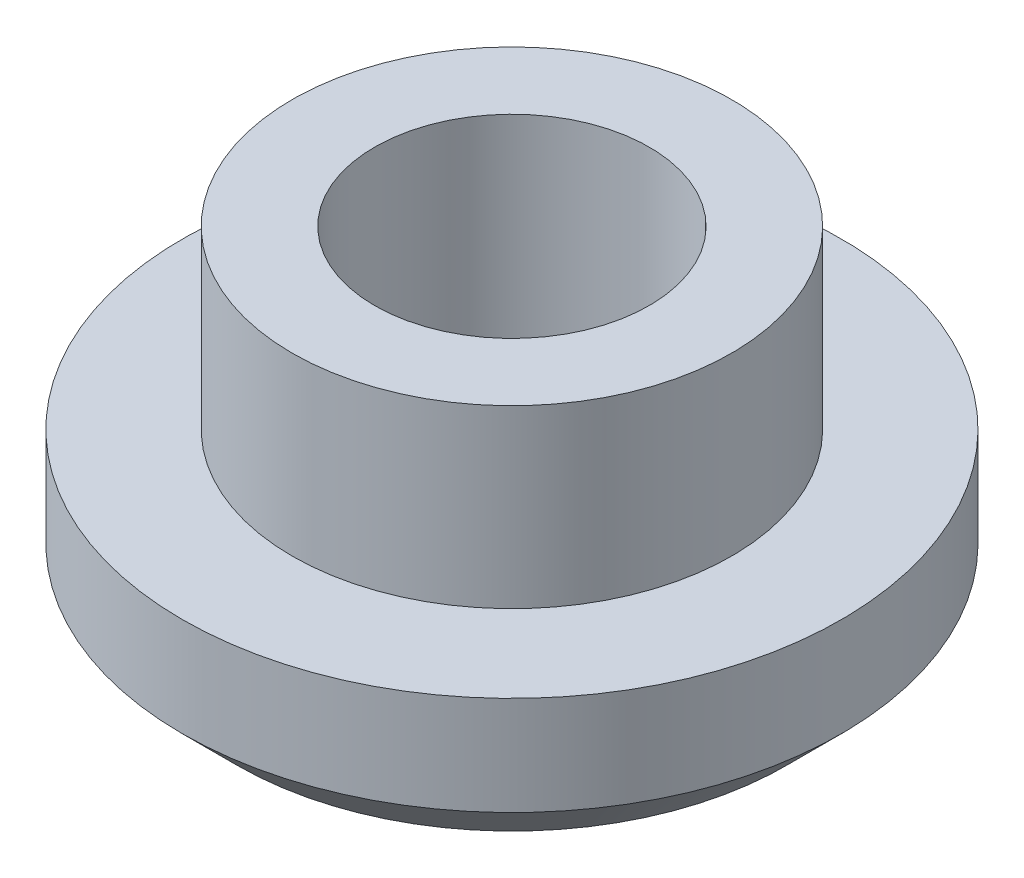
from build123d import *

# Parameters (mm, degrees)
SKETCH1_R      = 6
EXTRUDE1_DEPTH = 2.8
CHAMFER1_SIZE  = 1
SKETCH2_R      = 4
EXTRUDE2_DEPTH = 3.2
SKETCH3_R      = 2.5
EXTRUDE3_DEPTH = 11.392304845


with BuildPart() as part:
    # Sketch1 → Extrude1 (new body)
    with BuildSketch(Plane(origin=(0, 0, 0), x_dir=(1, 0, 0), z_dir=(0, 1, 0))):
        with Locations(Location((0, 0, 0), (0, 0, 270))):
            Circle(SKETCH1_R)
    extrude(amount=EXTRUDE1_DEPTH)

    # Chamfer1
    chamfer1_edges = [part.edges().sort_by_distance(p)[0] for p in [
        (0, 0, -6),
    ]]
    chamfer(chamfer1_edges, length=CHAMFER1_SIZE)

    # Sketch2 → Extrude2 (add)
    with BuildSketch(Plane(origin=(0, 2.8, 0), x_dir=(1, 0, 0), z_dir=(0, 1, 0))):
        with Locations(Location((0, 0, 0), (0, 0, 270))):
            Circle(SKETCH2_R)
    extrude(amount=EXTRUDE2_DEPTH)

    # Sketch3 → Extrude3 (cut, through all)
    with BuildSketch(Plane(origin=(0, 6, 0), x_dir=(1, 0, 0), z_dir=(0, 1, 0))):
        with Locations(Location((0, 0, 0), (0, 0, 270))):
            Circle(SKETCH3_R)
    extrude(amount=-EXTRUDE3_DEPTH, mode=Mode.SUBTRACT)


solid = part.part
